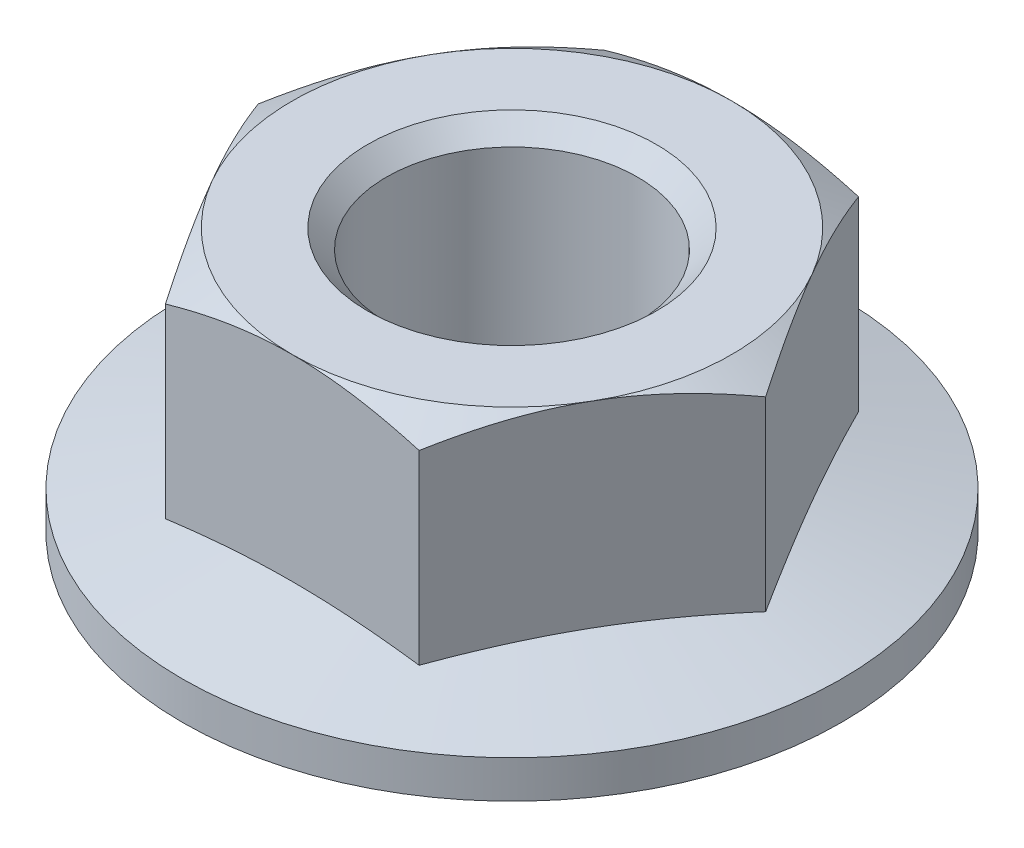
from build123d import *
from build123d.topology import SkipClean

# Parameters (mm, degrees)
CUT_EXTRUDE1_REACH = 10.53
SKETCH3_R          = 6.041451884
SCALE1_SCALE       = 1.2


with BuildPart() as part:
    # Sketch1 → Nut (revolve)
    with BuildSketch(Plane.XY, mode=Mode.PRIVATE) as nut_sk:
        Polygon((2, 1.8), (2, -1.8), (2.3, -2.1), (5.25, -2.1), (5.25, -1.5), (4.041451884, -1.176170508), (4.041451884, 1.787392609), (3.5, 2.1), (2.3, 2.1), align=None)
    revolve(nut_sk.sketch.rotate(Axis((0, 1.4, 0), (0, -1, 0)), 90), axis=Axis((0, 1.4, 0), (0, -1, 0)))

    # Cut-Extrude1: up to this cone (the profile starts outside it)
    with SkipClean():  # the faces are left unmerged after this step: merging them gives an invalid solid
        cut_extrude1_end = Plane(origin=(0, 2.1, 0), z_dir=(0, -1, 0)).offset(2.19326774) * Cone(3.732e-06, 32.9791375, 8.83673226, align=(Align.CENTER, Align.CENTER, Align.MIN), mode=Mode.PRIVATE)
        # Sketch3 → Cut-Extrude1 (cut, up to the surface)
        with BuildSketch(Plane(origin=(0, 2.1, 0), x_dir=(1, 0, 0), z_dir=(0, 1, 0)), mode=Mode.PRIVATE) as cut_extrude1_sk1:
            Circle(SKETCH3_R)
            Polygon((4.041451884, 0), (2.020725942, 3.5), (-2.020725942, 3.5), (-4.041451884, 0), (-2.020725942, -3.5), (2.020725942, -3.5), align=None, mode=Mode.SUBTRACT)
        cut_extrude1_tool1 = extrude(cut_extrude1_sk1.sketch, amount=-CUT_EXTRUDE1_REACH, mode=Mode.PRIVATE) - cut_extrude1_end
        add(cut_extrude1_tool1.solids().sort_by_distance((-5.870574, 2.1, 0))[0], mode=Mode.SUBTRACT)


with BuildPart() as part_1:
    # Scale1: scaled about (0, -0.379858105, 0)
    add(part.part.scale(SCALE1_SCALE).moved(Location((0, 0.075971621, 0))))


solid = part_1.part
